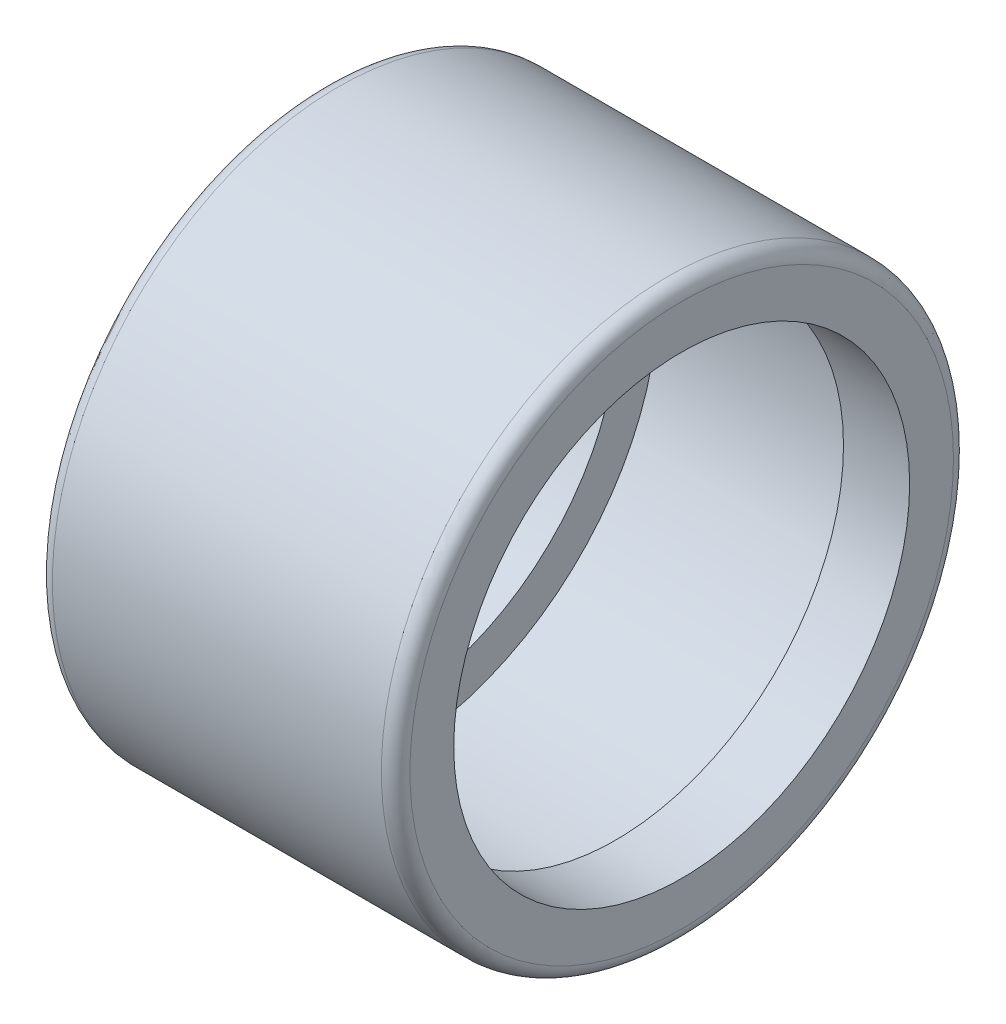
from build123d import *


with BuildPart() as part:
    # Esquisse1 → R_volution1 (revolve)
    with BuildSketch(Plane.XY, mode=Mode.PRIVATE) as r_volution1_sk:
        with BuildLine():
            Line((9.6, 8), (0.4, 8))
            ThreePointArc((0.4, 8), (0.117157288, 7.882842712), (0, 7.6))
            Line((0, 7.6), (0, 6.375))
            Line((0, 6.375), (1.85, 6.375))
            Line((1.85, 6.375), (1.85, 7.5))
            Line((1.85, 7.5), (8.15, 7.5))
            Line((8.15, 7.5), (8.15, 6.375))
            Line((8.15, 6.375), (10, 6.375))
            Line((10, 6.375), (10, 7.6))
            ThreePointArc((10, 7.6), (9.882842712, 7.882842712), (9.6, 8))
        make_face()
    revolve(r_volution1_sk.sketch.rotate(Axis((-0.001353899, 0, 0), (1, 0, 0)), 270), axis=Axis((-0.001353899, 0, 0), (1, 0, 0)))


solid = part.part
